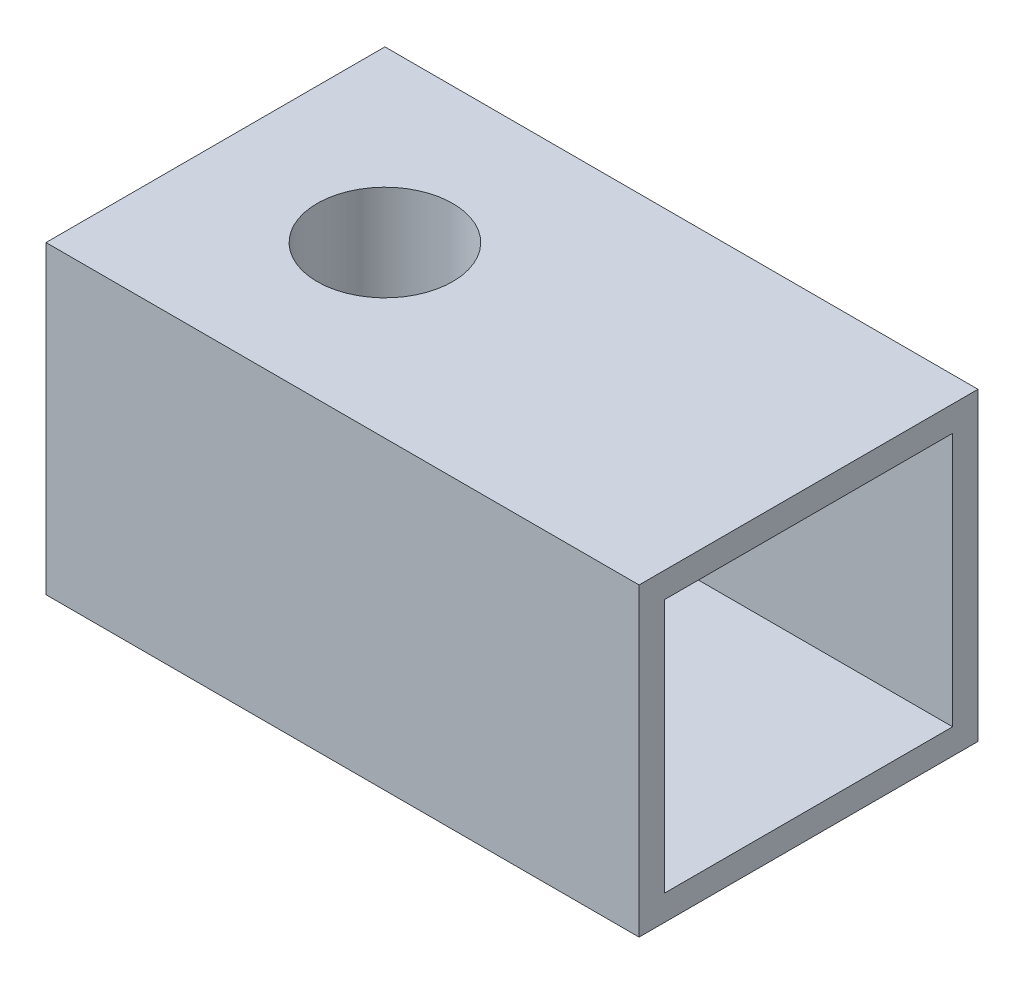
ISO-10303-21;
HEADER;
FILE_DESCRIPTION(('STEP AP214'),'2;1');
FILE_NAME('part.step','',(''),(''),'','','');
FILE_SCHEMA(('AUTOMOTIVE_DESIGN { 1 0 10303 214 1 1 1 1 }'));
ENDSEC;
DATA;
#1=APPLICATION_CONTEXT('core data for automotive mechanical design processes');
#2=APPLICATION_PROTOCOL_DEFINITION('international standard','automotive_design',2000,#1);
#3=PRODUCT_CONTEXT('',#1,'mechanical');
#4=PRODUCT('Part','Part','',(#3));
#5=PRODUCT_RELATED_PRODUCT_CATEGORY('part','',(#4));
#6=PRODUCT_DEFINITION_FORMATION('','',#4);
#7=PRODUCT_DEFINITION_CONTEXT('part definition',#1,'design');
#8=PRODUCT_DEFINITION('design','',#6,#7);
#9=PRODUCT_DEFINITION_SHAPE('','',#8);
#10=(LENGTH_UNIT() NAMED_UNIT(*) SI_UNIT(.MILLI.,.METRE.));
#11=(NAMED_UNIT(*) PLANE_ANGLE_UNIT() SI_UNIT($,.RADIAN.));
#12=(NAMED_UNIT(*) SI_UNIT($,.STERADIAN.) SOLID_ANGLE_UNIT());
#13=UNCERTAINTY_MEASURE_WITH_UNIT(LENGTH_MEASURE(1.E-05),#10,'distance_accuracy_value','');
#14=(GEOMETRIC_REPRESENTATION_CONTEXT(3) GLOBAL_UNCERTAINTY_ASSIGNED_CONTEXT((#13)) GLOBAL_UNIT_ASSIGNED_CONTEXT((#10,
#11,#12)) REPRESENTATION_CONTEXT('',''));
#15=CARTESIAN_POINT('',(0.,0.,0.));
#16=DIRECTION('',(0.,0.,1.));
#17=DIRECTION('',(1.,0.,0.));
#18=AXIS2_PLACEMENT_3D('',#15,#16,#17);
#19=CARTESIAN_POINT('',(0.,18.,0.));
#20=DIRECTION('',(0.,1.,0.));
#21=DIRECTION('',(0.,0.,1.));
#22=AXIS2_PLACEMENT_3D('',#19,#20,#21);
#23=PLANE('',#22);
#24=DIRECTION('',(0.,0.,-1.));
#25=VECTOR('',#24,1.);
#26=CARTESIAN_POINT('',(17.5,18.,-10.));
#27=LINE('',#26,#25);
#28=CARTESIAN_POINT('',(17.5,18.,10.));
#29=VERTEX_POINT('',#28);
#30=CARTESIAN_POINT('',(17.5,18.,-10.));
#31=VERTEX_POINT('',#30);
#32=EDGE_CURVE('E146',#29,#31,#27,.T.);
#33=ORIENTED_EDGE('',*,*,#32,.T.);
#34=DIRECTION('',(-1.,0.,0.));
#35=VECTOR('',#34,1.);
#36=CARTESIAN_POINT('',(-17.5,18.,-10.));
#37=LINE('',#36,#35);
#38=CARTESIAN_POINT('',(-17.5,18.,-10.));
#39=VERTEX_POINT('',#38);
#40=EDGE_CURVE('E149',#31,#39,#37,.T.);
#41=ORIENTED_EDGE('',*,*,#40,.T.);
#42=DIRECTION('',(0.,0.,1.));
#43=VECTOR('',#42,1.);
#44=CARTESIAN_POINT('',(-17.5,18.,-10.));
#45=LINE('',#44,#43);
#46=CARTESIAN_POINT('',(-17.5,18.,10.));
#47=VERTEX_POINT('',#46);
#48=EDGE_CURVE('E152',#39,#47,#45,.T.);
#49=ORIENTED_EDGE('',*,*,#48,.T.);
#50=DIRECTION('',(1.,0.,0.));
#51=VECTOR('',#50,1.);
#52=CARTESIAN_POINT('',(-17.5,18.,10.));
#53=LINE('',#52,#51);
#54=EDGE_CURVE('E154',#47,#29,#53,.T.);
#55=ORIENTED_EDGE('',*,*,#54,.T.);
#56=EDGE_LOOP('',(#33,#41,#49,#55));
#57=FACE_BOUND('',#56,.T.);
#58=CARTESIAN_POINT('',(-7.5,18.,0.));
#59=DIRECTION('',(0.,1.,0.));
#60=DIRECTION('',(0.,0.,1.));
#61=AXIS2_PLACEMENT_3D('',#58,#59,#60);
#62=CIRCLE('',#61,4.);
#63=CARTESIAN_POINT('',(-7.5,18.,4.));
#64=VERTEX_POINT('',#63);
#65=EDGE_CURVE('E133',#64,#64,#62,.T.);
#66=ORIENTED_EDGE('',*,*,#65,.F.);
#67=EDGE_LOOP('',(#66));
#68=FACE_BOUND('',#67,.T.);
#69=ADVANCED_FACE('F33',(#57,#68),#23,.T.);
#70=CARTESIAN_POINT('',(0.,0.,0.));
#71=DIRECTION('',(0.,1.,0.));
#72=DIRECTION('',(0.,0.,1.));
#73=AXIS2_PLACEMENT_3D('',#70,#71,#72);
#74=PLANE('',#73);
#75=DIRECTION('',(0.,0.,-1.));
#76=VECTOR('',#75,1.);
#77=CARTESIAN_POINT('',(17.5,0.,-10.));
#78=LINE('',#77,#76);
#79=CARTESIAN_POINT('',(17.5,0.,10.));
#80=VERTEX_POINT('',#79);
#81=CARTESIAN_POINT('',(17.5,0.,-10.));
#82=VERTEX_POINT('',#81);
#83=EDGE_CURVE('E144',#80,#82,#78,.T.);
#84=ORIENTED_EDGE('',*,*,#83,.F.);
#85=DIRECTION('',(1.,0.,0.));
#86=VECTOR('',#85,1.);
#87=CARTESIAN_POINT('',(-17.5,0.,10.));
#88=LINE('',#87,#86);
#89=CARTESIAN_POINT('',(-17.5,0.,10.));
#90=VERTEX_POINT('',#89);
#91=EDGE_CURVE('E150',#90,#80,#88,.T.);
#92=ORIENTED_EDGE('',*,*,#91,.F.);
#93=DIRECTION('',(0.,0.,1.));
#94=VECTOR('',#93,1.);
#95=CARTESIAN_POINT('',(-17.5,0.,-10.));
#96=LINE('',#95,#94);
#97=CARTESIAN_POINT('',(-17.5,0.,-10.));
#98=VERTEX_POINT('',#97);
#99=EDGE_CURVE('E161',#98,#90,#96,.T.);
#100=ORIENTED_EDGE('',*,*,#99,.F.);
#101=DIRECTION('',(-1.,0.,0.));
#102=VECTOR('',#101,1.);
#103=CARTESIAN_POINT('',(-17.5,0.,-10.));
#104=LINE('',#103,#102);
#105=EDGE_CURVE('E159',#82,#98,#104,.T.);
#106=ORIENTED_EDGE('',*,*,#105,.F.);
#107=EDGE_LOOP('',(#84,#92,#100,#106));
#108=FACE_BOUND('',#107,.T.);
#109=CARTESIAN_POINT('',(-7.5,0.,0.));
#110=DIRECTION('',(0.,1.,0.));
#111=DIRECTION('',(0.,0.,1.));
#112=AXIS2_PLACEMENT_3D('',#109,#110,#111);
#113=CIRCLE('',#112,4.);
#114=CARTESIAN_POINT('',(-7.5,0.,4.));
#115=VERTEX_POINT('',#114);
#116=EDGE_CURVE('E129',#115,#115,#113,.T.);
#117=ORIENTED_EDGE('',*,*,#116,.T.);
#118=EDGE_LOOP('',(#117));
#119=FACE_BOUND('',#118,.T.);
#120=ADVANCED_FACE('F179',(#108,#119),#74,.F.);
#121=CARTESIAN_POINT('',(17.5,18.,-10.));
#122=DIRECTION('',(-1.,0.,0.));
#123=DIRECTION('',(0.,0.,1.));
#124=AXIS2_PLACEMENT_3D('',#121,#122,#123);
#125=PLANE('',#124);
#126=DIRECTION('',(0.,0.,1.));
#127=VECTOR('',#126,1.);
#128=CARTESIAN_POINT('',(17.5,16.5,8.5));
#129=LINE('',#128,#127);
#130=CARTESIAN_POINT('',(17.5,16.5,-8.5));
#131=VERTEX_POINT('',#130);
#132=CARTESIAN_POINT('',(17.5,16.5,8.5));
#133=VERTEX_POINT('',#132);
#134=EDGE_CURVE('E329',#131,#133,#129,.T.);
#135=ORIENTED_EDGE('',*,*,#134,.F.);
#136=DIRECTION('',(0.,1.,0.));
#137=VECTOR('',#136,1.);
#138=CARTESIAN_POINT('',(17.5,16.5,-8.5));
#139=LINE('',#138,#137);
#140=CARTESIAN_POINT('',(17.5,1.5,-8.5));
#141=VERTEX_POINT('',#140);
#142=EDGE_CURVE('E327',#141,#131,#139,.T.);
#143=ORIENTED_EDGE('',*,*,#142,.F.);
#144=DIRECTION('',(0.,0.,-1.));
#145=VECTOR('',#144,1.);
#146=CARTESIAN_POINT('',(17.5,1.5,8.5));
#147=LINE('',#146,#145);
#148=CARTESIAN_POINT('',(17.5,1.5,8.5));
#149=VERTEX_POINT('',#148);
#150=EDGE_CURVE('E127',#149,#141,#147,.T.);
#151=ORIENTED_EDGE('',*,*,#150,.F.);
#152=DIRECTION('',(0.,-1.,0.));
#153=VECTOR('',#152,1.);
#154=CARTESIAN_POINT('',(17.5,16.5,8.5));
#155=LINE('',#154,#153);
#156=EDGE_CURVE('E337',#133,#149,#155,.T.);
#157=ORIENTED_EDGE('',*,*,#156,.F.);
#158=EDGE_LOOP('',(#135,#143,#151,#157));
#159=FACE_BOUND('',#158,.T.);
#160=ORIENTED_EDGE('',*,*,#83,.T.);
#161=DIRECTION('',(0.,-1.,0.));
#162=VECTOR('',#161,1.);
#163=CARTESIAN_POINT('',(17.5,18.,-10.));
#164=LINE('',#163,#162);
#165=EDGE_CURVE('E11',#31,#82,#164,.T.);
#166=ORIENTED_EDGE('',*,*,#165,.F.);
#167=ORIENTED_EDGE('',*,*,#32,.F.);
#168=DIRECTION('',(0.,-1.,0.));
#169=VECTOR('',#168,1.);
#170=CARTESIAN_POINT('',(17.5,18.,10.));
#171=LINE('',#170,#169);
#172=EDGE_CURVE('E156',#29,#80,#171,.T.);
#173=ORIENTED_EDGE('',*,*,#172,.T.);
#174=EDGE_LOOP('',(#160,#166,#167,#173));
#175=FACE_BOUND('',#174,.T.);
#176=ADVANCED_FACE('F35',(#159,#175),#125,.F.);
#177=CARTESIAN_POINT('',(-17.5,18.,-10.));
#178=DIRECTION('',(0.,0.,1.));
#179=DIRECTION('',(1.,0.,0.));
#180=AXIS2_PLACEMENT_3D('',#177,#178,#179);
#181=PLANE('',#180);
#182=DIRECTION('',(-1.,0.,0.));
#183=VECTOR('',#182,1.);
#184=CARTESIAN_POINT('',(-17.5,16.5,-10.));
#185=LINE('',#184,#183);
#186=CARTESIAN_POINT('',(2.5,16.5,-10.));
#187=VERTEX_POINT('',#186);
#188=CARTESIAN_POINT('',(-2.5,16.5,-10.));
#189=VERTEX_POINT('',#188);
#190=EDGE_CURVE('E326',#187,#189,#185,.T.);
#191=ORIENTED_EDGE('',*,*,#190,.T.);
#192=DIRECTION('',(0.,-1.,0.));
#193=VECTOR('',#192,1.);
#194=CARTESIAN_POINT('',(-2.5,18.,-10.));
#195=LINE('',#194,#193);
#196=CARTESIAN_POINT('',(-2.5,1.5,-10.));
#197=VERTEX_POINT('',#196);
#198=EDGE_CURVE('E320',#189,#197,#195,.T.);
#199=ORIENTED_EDGE('',*,*,#198,.T.);
#200=DIRECTION('',(1.,0.,0.));
#201=VECTOR('',#200,1.);
#202=CARTESIAN_POINT('',(-17.5,1.5,-10.));
#203=LINE('',#202,#201);
#204=CARTESIAN_POINT('',(2.5,1.5,-10.));
#205=VERTEX_POINT('',#204);
#206=EDGE_CURVE('E324',#197,#205,#203,.T.);
#207=ORIENTED_EDGE('',*,*,#206,.T.);
#208=DIRECTION('',(0.,1.,0.));
#209=VECTOR('',#208,1.);
#210=CARTESIAN_POINT('',(2.5,18.,-10.));
#211=LINE('',#210,#209);
#212=EDGE_CURVE('E116',#205,#187,#211,.T.);
#213=ORIENTED_EDGE('',*,*,#212,.T.);
#214=EDGE_LOOP('',(#191,#199,#207,#213));
#215=FACE_BOUND('',#214,.T.);
#216=ORIENTED_EDGE('',*,*,#105,.T.);
#217=DIRECTION('',(0.,-1.,0.));
#218=VECTOR('',#217,1.);
#219=CARTESIAN_POINT('',(-17.5,18.,-10.));
#220=LINE('',#219,#218);
#221=EDGE_CURVE('E41',#39,#98,#220,.T.);
#222=ORIENTED_EDGE('',*,*,#221,.F.);
#223=ORIENTED_EDGE('',*,*,#40,.F.);
#224=ORIENTED_EDGE('',*,*,#165,.T.);
#225=EDGE_LOOP('',(#216,#222,#223,#224));
#226=FACE_BOUND('',#225,.T.);
#227=ADVANCED_FACE('F190',(#215,#226),#181,.F.);
#228=CARTESIAN_POINT('',(-17.5,18.,-10.));
#229=DIRECTION('',(1.,0.,0.));
#230=DIRECTION('',(0.,0.,-1.));
#231=AXIS2_PLACEMENT_3D('',#228,#229,#230);
#232=PLANE('',#231);
#233=ORIENTED_EDGE('',*,*,#99,.T.);
#234=DIRECTION('',(0.,-1.,0.));
#235=VECTOR('',#234,1.);
#236=CARTESIAN_POINT('',(-17.5,18.,10.));
#237=LINE('',#236,#235);
#238=EDGE_CURVE('E166',#47,#90,#237,.T.);
#239=ORIENTED_EDGE('',*,*,#238,.F.);
#240=ORIENTED_EDGE('',*,*,#48,.F.);
#241=ORIENTED_EDGE('',*,*,#221,.T.);
#242=EDGE_LOOP('',(#233,#239,#240,#241));
#243=FACE_BOUND('',#242,.T.);
#244=ADVANCED_FACE('F173',(#243),#232,.F.);
#245=CARTESIAN_POINT('',(-17.5,18.,10.));
#246=DIRECTION('',(0.,0.,-1.));
#247=DIRECTION('',(-1.,0.,0.));
#248=AXIS2_PLACEMENT_3D('',#245,#246,#247);
#249=PLANE('',#248);
#250=ORIENTED_EDGE('',*,*,#91,.T.);
#251=ORIENTED_EDGE('',*,*,#172,.F.);
#252=ORIENTED_EDGE('',*,*,#54,.F.);
#253=ORIENTED_EDGE('',*,*,#238,.T.);
#254=EDGE_LOOP('',(#250,#251,#252,#253));
#255=FACE_BOUND('',#254,.T.);
#256=ADVANCED_FACE('F183',(#255),#249,.F.);
#257=CARTESIAN_POINT('',(-7.5,18.,0.));
#258=DIRECTION('',(0.,-1.,0.));
#259=DIRECTION('',(0.,0.,-1.));
#260=AXIS2_PLACEMENT_3D('',#257,#258,#259);
#261=CYLINDRICAL_SURFACE('',#260,4.);
#262=ORIENTED_EDGE('',*,*,#65,.T.);
#263=EDGE_LOOP('',(#262));
#264=FACE_BOUND('',#263,.T.);
#265=ORIENTED_EDGE('',*,*,#116,.F.);
#266=EDGE_LOOP('',(#265));
#267=FACE_BOUND('',#266,.T.);
#268=ADVANCED_FACE('F207',(#264,#267),#261,.F.);
#269=CARTESIAN_POINT('',(-2.5,16.5,-8.49999999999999));
#270=DIRECTION('',(0.,0.,-1.));
#271=DIRECTION('',(-1.,0.,0.));
#272=AXIS2_PLACEMENT_3D('',#269,#270,#271);
#273=PLANE('',#272);
#274=DIRECTION('',(1.,0.,0.));
#275=VECTOR('',#274,1.);
#276=CARTESIAN_POINT('',(-2.5,16.5,-8.49999999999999));
#277=LINE('',#276,#275);
#278=CARTESIAN_POINT('',(2.5,16.5,-8.49999999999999));
#279=VERTEX_POINT('',#278);
#280=EDGE_CURVE('E56',#279,#131,#277,.T.);
#281=ORIENTED_EDGE('',*,*,#280,.F.);
#282=DIRECTION('',(0.,1.,0.));
#283=VECTOR('',#282,1.);
#284=CARTESIAN_POINT('',(2.5,16.5,-8.49999999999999));
#285=LINE('',#284,#283);
#286=CARTESIAN_POINT('',(2.5,1.5,-8.49999999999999));
#287=VERTEX_POINT('',#286);
#288=EDGE_CURVE('E114',#287,#279,#285,.T.);
#289=ORIENTED_EDGE('',*,*,#288,.F.);
#290=DIRECTION('',(1.,0.,0.));
#291=VECTOR('',#290,1.);
#292=CARTESIAN_POINT('',(-2.5,1.5,-8.49999999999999));
#293=LINE('',#292,#291);
#294=EDGE_CURVE('E122',#287,#141,#293,.T.);
#295=ORIENTED_EDGE('',*,*,#294,.T.);
#296=ORIENTED_EDGE('',*,*,#142,.T.);
#297=EDGE_LOOP('',(#281,#289,#295,#296));
#298=FACE_BOUND('',#297,.T.);
#299=ADVANCED_FACE('F121',(#298),#273,.F.);
#300=CARTESIAN_POINT('',(-2.49999999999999,1.5,8.50000000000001));
#301=DIRECTION('',(0.,-1.,0.));
#302=DIRECTION('',(0.,0.,-1.));
#303=AXIS2_PLACEMENT_3D('',#300,#301,#302);
#304=PLANE('',#303);
#305=ORIENTED_EDGE('',*,*,#150,.T.);
#306=ORIENTED_EDGE('',*,*,#294,.F.);
#307=DIRECTION('',(0.,0.,1.));
#308=VECTOR('',#307,1.);
#309=CARTESIAN_POINT('',(2.5,1.5,-11.5));
#310=LINE('',#309,#308);
#311=EDGE_CURVE('E48',#205,#287,#310,.T.);
#312=ORIENTED_EDGE('',*,*,#311,.F.);
#313=ORIENTED_EDGE('',*,*,#206,.F.);
#314=DIRECTION('',(0.,0.,-1.));
#315=VECTOR('',#314,1.);
#316=CARTESIAN_POINT('',(-2.49999999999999,1.5,8.50000000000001));
#317=LINE('',#316,#315);
#318=CARTESIAN_POINT('',(-2.49999999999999,1.5,8.50000000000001));
#319=VERTEX_POINT('',#318);
#320=EDGE_CURVE('E142',#319,#197,#317,.T.);
#321=ORIENTED_EDGE('',*,*,#320,.F.);
#322=DIRECTION('',(1.,0.,0.));
#323=VECTOR('',#322,1.);
#324=CARTESIAN_POINT('',(-2.49999999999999,1.5,8.50000000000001));
#325=LINE('',#324,#323);
#326=EDGE_CURVE('E130',#319,#149,#325,.T.);
#327=ORIENTED_EDGE('',*,*,#326,.T.);
#328=EDGE_LOOP('',(#305,#306,#312,#313,#321,#327));
#329=FACE_BOUND('',#328,.T.);
#330=ADVANCED_FACE('F125',(#329),#304,.F.);
#331=CARTESIAN_POINT('',(-2.49999999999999,16.5,8.50000000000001));
#332=DIRECTION('',(0.,0.,1.));
#333=DIRECTION('',(1.,0.,0.));
#334=AXIS2_PLACEMENT_3D('',#331,#332,#333);
#335=PLANE('',#334);
#336=ORIENTED_EDGE('',*,*,#156,.T.);
#337=ORIENTED_EDGE('',*,*,#326,.F.);
#338=DIRECTION('',(0.,-1.,0.));
#339=VECTOR('',#338,1.);
#340=CARTESIAN_POINT('',(-2.49999999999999,16.5,8.50000000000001));
#341=LINE('',#340,#339);
#342=CARTESIAN_POINT('',(-2.49999999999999,16.5,8.50000000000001));
#343=VERTEX_POINT('',#342);
#344=EDGE_CURVE('E322',#343,#319,#341,.T.);
#345=ORIENTED_EDGE('',*,*,#344,.F.);
#346=DIRECTION('',(1.,0.,0.));
#347=VECTOR('',#346,1.);
#348=CARTESIAN_POINT('',(-2.49999999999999,16.5,8.50000000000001));
#349=LINE('',#348,#347);
#350=EDGE_CURVE('E135',#343,#133,#349,.T.);
#351=ORIENTED_EDGE('',*,*,#350,.T.);
#352=EDGE_LOOP('',(#336,#337,#345,#351));
#353=FACE_BOUND('',#352,.T.);
#354=ADVANCED_FACE('F224',(#353),#335,.F.);
#355=CARTESIAN_POINT('',(-2.49999999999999,16.5,8.50000000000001));
#356=DIRECTION('',(0.,1.,0.));
#357=DIRECTION('',(0.,0.,1.));
#358=AXIS2_PLACEMENT_3D('',#355,#356,#357);
#359=PLANE('',#358);
#360=ORIENTED_EDGE('',*,*,#134,.T.);
#361=ORIENTED_EDGE('',*,*,#350,.F.);
#362=DIRECTION('',(0.,0.,1.));
#363=VECTOR('',#362,1.);
#364=CARTESIAN_POINT('',(-2.49999999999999,16.5,8.50000000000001));
#365=LINE('',#364,#363);
#366=EDGE_CURVE('E334',#189,#343,#365,.T.);
#367=ORIENTED_EDGE('',*,*,#366,.F.);
#368=ORIENTED_EDGE('',*,*,#190,.F.);
#369=DIRECTION('',(0.,0.,1.));
#370=VECTOR('',#369,1.);
#371=CARTESIAN_POINT('',(2.5,16.5,-11.5));
#372=LINE('',#371,#370);
#373=EDGE_CURVE('E118',#187,#279,#372,.T.);
#374=ORIENTED_EDGE('',*,*,#373,.T.);
#375=ORIENTED_EDGE('',*,*,#280,.T.);
#376=EDGE_LOOP('',(#360,#361,#367,#368,#374,#375));
#377=FACE_BOUND('',#376,.T.);
#378=ADVANCED_FACE('F227',(#377),#359,.F.);
#379=CARTESIAN_POINT('',(-2.5,0.,0.));
#380=DIRECTION('',(1.,0.,0.));
#381=DIRECTION('',(0.,0.,-1.));
#382=AXIS2_PLACEMENT_3D('',#379,#380,#381);
#383=PLANE('',#382);
#384=ORIENTED_EDGE('',*,*,#320,.T.);
#385=ORIENTED_EDGE('',*,*,#198,.F.);
#386=ORIENTED_EDGE('',*,*,#366,.T.);
#387=ORIENTED_EDGE('',*,*,#344,.T.);
#388=EDGE_LOOP('',(#384,#385,#386,#387));
#389=FACE_BOUND('',#388,.T.);
#390=ADVANCED_FACE('F230',(#389),#383,.T.);
#391=CARTESIAN_POINT('',(2.5,16.5,-11.5));
#392=DIRECTION('',(1.,0.,0.));
#393=DIRECTION('',(0.,1.,0.));
#394=AXIS2_PLACEMENT_3D('',#391,#392,#393);
#395=PLANE('',#394);
#396=ORIENTED_EDGE('',*,*,#311,.T.);
#397=ORIENTED_EDGE('',*,*,#288,.T.);
#398=ORIENTED_EDGE('',*,*,#373,.F.);
#399=ORIENTED_EDGE('',*,*,#212,.F.);
#400=EDGE_LOOP('',(#396,#397,#398,#399));
#401=FACE_BOUND('',#400,.T.);
#402=ADVANCED_FACE('F112',(#401),#395,.F.);
#403=CLOSED_SHELL('',(#69,#120,#176,#227,#244,#256,#268,#299,#330,#354,#378,#390,#402));
#404=MANIFOLD_SOLID_BREP('B2',#403);
#405=ADVANCED_BREP_SHAPE_REPRESENTATION('',(#18,#404),#14);
#406=SHAPE_DEFINITION_REPRESENTATION(#9,#405);
ENDSEC;
END-ISO-10303-21;
